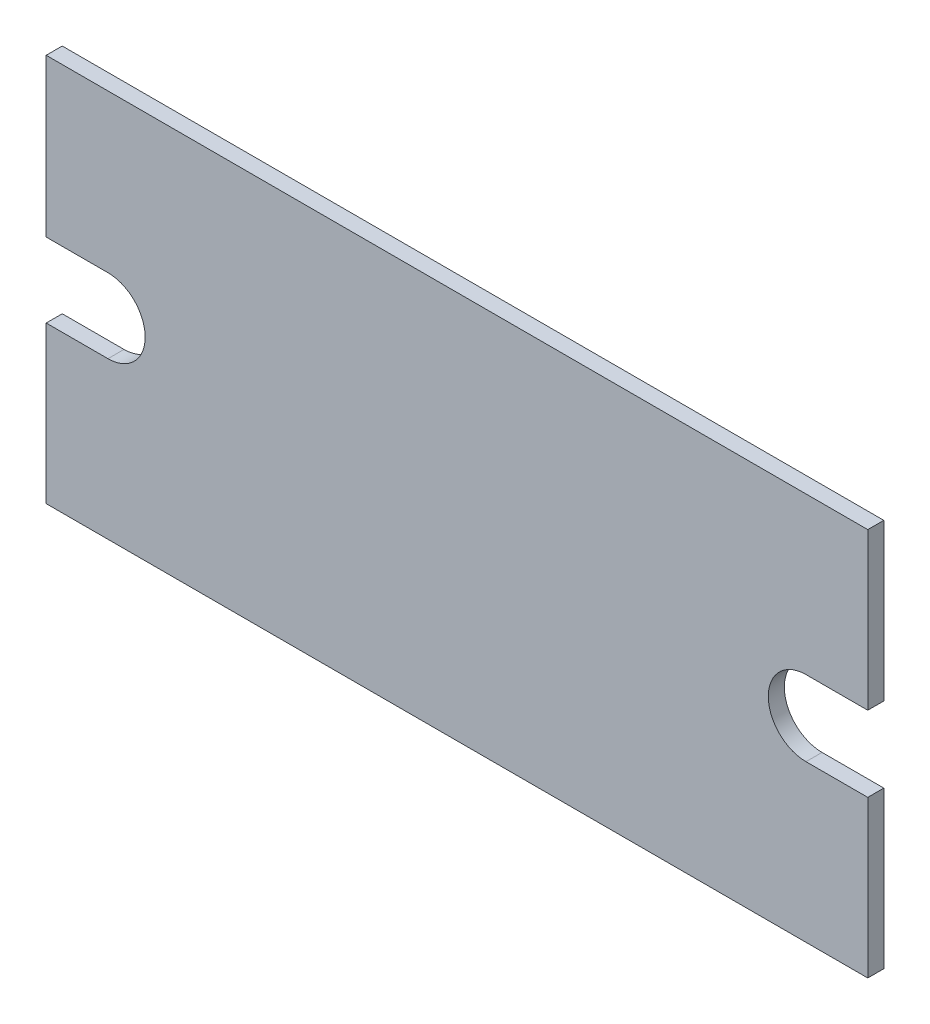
from build123d import *

# Parameters (mm, degrees)
P_IDAT_VYSUNUT_M1_DEPTH = 1


with BuildPart() as part:
    # Skica1 → P_idat vysunut_m1 (new body)
    with BuildSketch(Plane.XY):
        with BuildLine():
            Line((-17.494467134, 10.147055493), (23.932772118, 10.147055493))
            Line((23.932772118, 10.147055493), (23.932772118, 0.397055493))
            Line((23.932772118, 0.397055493), (20.082772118, 0.397055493))
            ThreePointArc((20.082772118, 0.397055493), (17.732772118, -1.952944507), (20.082772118, -4.302944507))
            Line((20.082772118, -4.302944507), (23.932772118, -4.302944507))
            Line((23.932772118, -4.302944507), (23.932772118, -14.052944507))
            Line((23.932772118, -14.052944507), (-27.267227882, -14.052944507))
            Line((-27.267227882, -14.052944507), (-27.267227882, -4.302944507))
            Line((-27.267227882, -4.302944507), (-23.417227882, -4.302944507))
            ThreePointArc((-23.417227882, -4.302944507), (-21.097869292, -1.983585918), (-23.417227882, 0.335772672))
            Line((-23.417227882, 0.335772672), (-27.267227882, 0.335772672))
            Line((-27.267227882, 0.335772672), (-27.267227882, 10.085772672))
            Line((-27.267227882, 10.085772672), (-27.267227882, 10.147055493))
            Line((-27.267227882, 10.147055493), (-17.494467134, 10.147055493))
        make_face()
    extrude(amount=P_IDAT_VYSUNUT_M1_DEPTH)


solid = part.part
